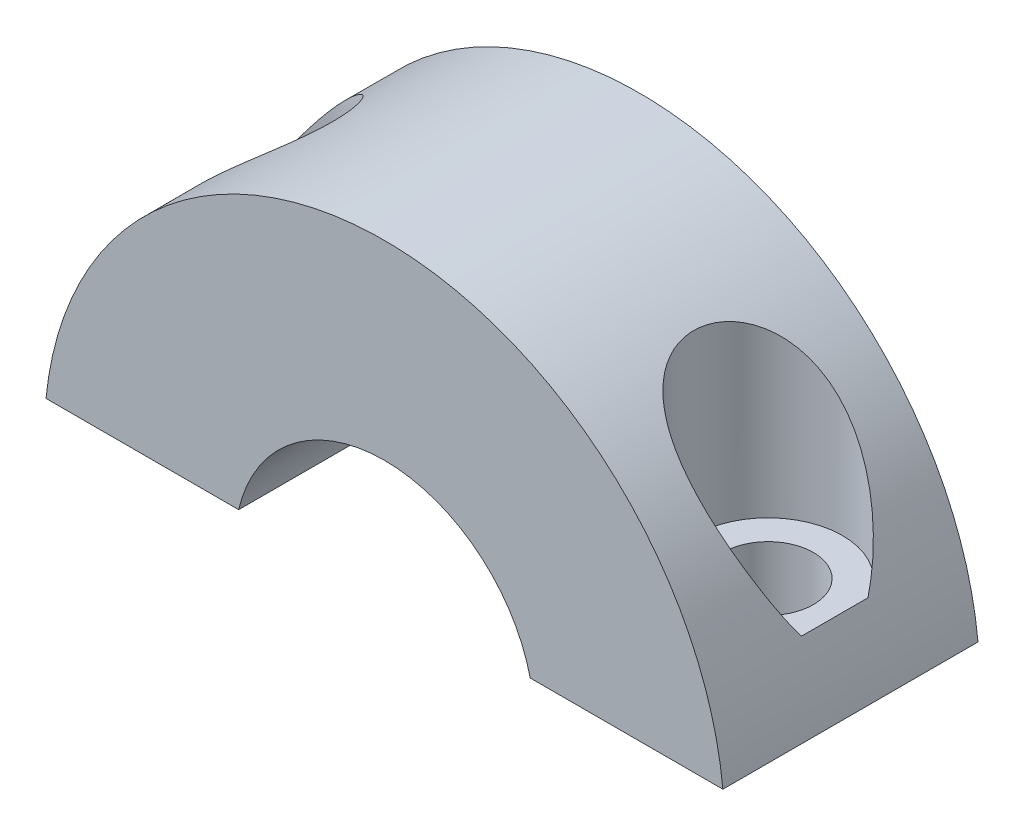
ISO-10303-21;
HEADER;
FILE_DESCRIPTION(('STEP AP214'),'2;1');
FILE_NAME('part.step','',(''),(''),'','','');
FILE_SCHEMA(('AUTOMOTIVE_DESIGN { 1 0 10303 214 1 1 1 1 }'));
ENDSEC;
DATA;
#1=APPLICATION_CONTEXT('core data for automotive mechanical design processes');
#2=APPLICATION_PROTOCOL_DEFINITION('international standard','automotive_design',2000,#1);
#3=PRODUCT_CONTEXT('',#1,'mechanical');
#4=PRODUCT('Part','Part','',(#3));
#5=PRODUCT_RELATED_PRODUCT_CATEGORY('part','',(#4));
#6=PRODUCT_DEFINITION_FORMATION('','',#4);
#7=PRODUCT_DEFINITION_CONTEXT('part definition',#1,'design');
#8=PRODUCT_DEFINITION('design','',#6,#7);
#9=PRODUCT_DEFINITION_SHAPE('','',#8);
#10=(LENGTH_UNIT() NAMED_UNIT(*) SI_UNIT(.MILLI.,.METRE.));
#11=(NAMED_UNIT(*) PLANE_ANGLE_UNIT() SI_UNIT($,.RADIAN.));
#12=(NAMED_UNIT(*) SI_UNIT($,.STERADIAN.) SOLID_ANGLE_UNIT());
#13=UNCERTAINTY_MEASURE_WITH_UNIT(LENGTH_MEASURE(1.E-05),#10,'distance_accuracy_value','');
#14=(GEOMETRIC_REPRESENTATION_CONTEXT(3) GLOBAL_UNCERTAINTY_ASSIGNED_CONTEXT((#13)) GLOBAL_UNIT_ASSIGNED_CONTEXT((#10,
#11,#12)) REPRESENTATION_CONTEXT('',''));
#15=CARTESIAN_POINT('',(0.,0.,0.));
#16=DIRECTION('',(0.,0.,1.));
#17=DIRECTION('',(1.,0.,0.));
#18=AXIS2_PLACEMENT_3D('',#15,#16,#17);
#19=CARTESIAN_POINT('',(-25.2726809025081,2.54,19.05));
#20=DIRECTION('',(0.,1.,0.));
#21=DIRECTION('',(0.,0.,1.));
#22=AXIS2_PLACEMENT_3D('',#19,#20,#21);
#23=PLANE('',#22);
#24=CARTESIAN_POINT('',(-19.05,2.54,9.4488));
#25=DIRECTION('',(0.,1.,0.));
#26=DIRECTION('',(0.,0.,1.));
#27=AXIS2_PLACEMENT_3D('',#24,#25,#26);
#28=CIRCLE('',#27,3.3782);
#29=CARTESIAN_POINT('',(-19.05,2.54,12.827));
#30=VERTEX_POINT('',#29);
#31=EDGE_CURVE('E180',#30,#30,#28,.T.);
#32=ORIENTED_EDGE('',*,*,#31,.T.);
#33=EDGE_LOOP('',(#32));
#34=FACE_BOUND('',#33,.T.);
#35=DIRECTION('',(1.,0.,0.));
#36=VECTOR('',#35,1.);
#37=CARTESIAN_POINT('',(-25.2726809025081,2.54,0.));
#38=LINE('',#37,#36);
#39=CARTESIAN_POINT('',(-25.2726809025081,2.54,0.));
#40=VERTEX_POINT('',#39);
#41=CARTESIAN_POINT('',(-10.8835369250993,2.54,0.));
#42=VERTEX_POINT('',#41);
#43=EDGE_CURVE('E183',#40,#42,#38,.T.);
#44=ORIENTED_EDGE('',*,*,#43,.T.);
#45=DIRECTION('',(0.,0.,-1.));
#46=VECTOR('',#45,1.);
#47=CARTESIAN_POINT('',(-10.8835369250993,2.54,19.05));
#48=LINE('',#47,#46);
#49=CARTESIAN_POINT('',(-10.8835369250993,2.54,19.05));
#50=VERTEX_POINT('',#49);
#51=EDGE_CURVE('E138',#50,#42,#48,.T.);
#52=ORIENTED_EDGE('',*,*,#51,.F.);
#53=DIRECTION('',(1.,0.,0.));
#54=VECTOR('',#53,1.);
#55=CARTESIAN_POINT('',(-25.2726809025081,2.54,19.05));
#56=LINE('',#55,#54);
#57=CARTESIAN_POINT('',(-25.2726809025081,2.54,19.05));
#58=VERTEX_POINT('',#57);
#59=EDGE_CURVE('E124',#58,#50,#56,.T.);
#60=ORIENTED_EDGE('',*,*,#59,.F.);
#61=DIRECTION('',(0.,0.,-1.));
#62=VECTOR('',#61,1.);
#63=CARTESIAN_POINT('',(-25.2726809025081,2.54,19.05));
#64=LINE('',#63,#62);
#65=EDGE_CURVE('E116',#58,#40,#64,.T.);
#66=ORIENTED_EDGE('',*,*,#65,.T.);
#67=EDGE_LOOP('',(#44,#52,#60,#66));
#68=FACE_BOUND('',#67,.T.);
#69=ADVANCED_FACE('F45',(#34,#68),#23,.F.);
#70=CARTESIAN_POINT('',(0.,0.,19.05));
#71=DIRECTION('',(0.,0.,-1.));
#72=DIRECTION('',(-1.,0.,0.));
#73=AXIS2_PLACEMENT_3D('',#70,#71,#72);
#74=CYLINDRICAL_SURFACE('',#73,11.176);
#75=CARTESIAN_POINT('',(0.,0.,0.));
#76=DIRECTION('',(0.,0.,1.));
#77=DIRECTION('',(1.,0.,0.));
#78=AXIS2_PLACEMENT_3D('',#75,#76,#77);
#79=CIRCLE('',#78,11.176);
#80=CARTESIAN_POINT('',(10.8835369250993,2.54,0.));
#81=VERTEX_POINT('',#80);
#82=EDGE_CURVE('E129',#81,#42,#79,.T.);
#83=ORIENTED_EDGE('',*,*,#82,.F.);
#84=DIRECTION('',(0.,0.,-1.));
#85=VECTOR('',#84,1.);
#86=CARTESIAN_POINT('',(10.8835369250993,2.54,19.05));
#87=LINE('',#86,#85);
#88=CARTESIAN_POINT('',(10.8835369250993,2.54,19.05));
#89=VERTEX_POINT('',#88);
#90=EDGE_CURVE('E136',#89,#81,#87,.T.);
#91=ORIENTED_EDGE('',*,*,#90,.F.);
#92=CARTESIAN_POINT('',(0.,0.,19.05));
#93=DIRECTION('',(0.,0.,1.));
#94=DIRECTION('',(1.,0.,0.));
#95=AXIS2_PLACEMENT_3D('',#92,#93,#94);
#96=CIRCLE('',#95,11.176);
#97=EDGE_CURVE('E127',#89,#50,#96,.T.);
#98=ORIENTED_EDGE('',*,*,#97,.T.);
#99=ORIENTED_EDGE('',*,*,#51,.T.);
#100=EDGE_LOOP('',(#83,#91,#98,#99));
#101=FACE_BOUND('',#100,.T.);
#102=ADVANCED_FACE('F171',(#101),#74,.F.);
#103=CARTESIAN_POINT('',(10.8835369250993,2.54,19.05));
#104=DIRECTION('',(0.,1.,0.));
#105=DIRECTION('',(0.,0.,1.));
#106=AXIS2_PLACEMENT_3D('',#103,#104,#105);
#107=PLANE('',#106);
#108=CARTESIAN_POINT('',(19.05,2.54,9.4488));
#109=DIRECTION('',(0.,1.,0.));
#110=DIRECTION('',(0.,0.,1.));
#111=AXIS2_PLACEMENT_3D('',#108,#109,#110);
#112=CIRCLE('',#111,3.3782);
#113=CARTESIAN_POINT('',(19.05,2.54,12.827));
#114=VERTEX_POINT('',#113);
#115=EDGE_CURVE('E198',#114,#114,#112,.T.);
#116=ORIENTED_EDGE('',*,*,#115,.T.);
#117=EDGE_LOOP('',(#116));
#118=FACE_BOUND('',#117,.T.);
#119=DIRECTION('',(1.,0.,0.));
#120=VECTOR('',#119,1.);
#121=CARTESIAN_POINT('',(10.8835369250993,2.54,0.));
#122=LINE('',#121,#120);
#123=CARTESIAN_POINT('',(25.2726809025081,2.54,0.));
#124=VERTEX_POINT('',#123);
#125=EDGE_CURVE('E125',#81,#124,#122,.T.);
#126=ORIENTED_EDGE('',*,*,#125,.T.);
#127=DIRECTION('',(0.,0.,-1.));
#128=VECTOR('',#127,1.);
#129=CARTESIAN_POINT('',(25.2726809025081,2.54,19.05));
#130=LINE('',#129,#128);
#131=CARTESIAN_POINT('',(25.2726809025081,2.54,19.05));
#132=VERTEX_POINT('',#131);
#133=EDGE_CURVE('E119',#132,#124,#130,.T.);
#134=ORIENTED_EDGE('',*,*,#133,.F.);
#135=DIRECTION('',(1.,0.,0.));
#136=VECTOR('',#135,1.);
#137=CARTESIAN_POINT('',(10.8835369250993,2.54,19.05));
#138=LINE('',#137,#136);
#139=EDGE_CURVE('E190',#89,#132,#138,.T.);
#140=ORIENTED_EDGE('',*,*,#139,.F.);
#141=ORIENTED_EDGE('',*,*,#90,.T.);
#142=EDGE_LOOP('',(#126,#134,#140,#141));
#143=FACE_BOUND('',#142,.T.);
#144=ADVANCED_FACE('F107',(#118,#143),#107,.F.);
#145=CARTESIAN_POINT('',(0.,0.,19.05));
#146=DIRECTION('',(0.,0.,-1.));
#147=DIRECTION('',(-1.,0.,0.));
#148=AXIS2_PLACEMENT_3D('',#145,#146,#147);
#149=CYLINDRICAL_SURFACE('',#148,25.4);
#150=DIRECTION('',(0.,0.,-1.));
#151=VECTOR('',#150,1.);
#152=CARTESIAN_POINT('',(24.0211360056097,8.255,19.05));
#153=LINE('',#152,#151);
#154=CARTESIAN_POINT('',(24.0211360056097,8.255,11.9306784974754));
#155=VERTEX_POINT('',#154);
#156=CARTESIAN_POINT('',(24.0211360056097,8.255,6.96692150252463));
#157=VERTEX_POINT('',#156);
#158=EDGE_CURVE('E13',#155,#157,#153,.T.);
#159=ORIENTED_EDGE('',*,*,#158,.F.);
#160=CARTESIAN_POINT('',(24.0211360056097,8.255,6.96692150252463));
#161=CARTESIAN_POINT('',(23.991830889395,8.34027801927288,6.90823569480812));
#162=CARTESIAN_POINT('',(23.961825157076,8.42611033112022,6.85072327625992));
#163=CARTESIAN_POINT('',(23.9004413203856,8.59867887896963,6.73784578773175));
#164=CARTESIAN_POINT('',(23.8690633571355,8.68541502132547,6.68248049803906));
#165=CARTESIAN_POINT('',(23.7729316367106,8.94662677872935,6.51933349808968));
#166=CARTESIAN_POINT('',(23.7061558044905,9.12217647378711,6.41445253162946));
#167=CARTESIAN_POINT('',(23.5673723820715,9.47496128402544,6.21146213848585));
#168=CARTESIAN_POINT('',(23.4953673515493,9.65219553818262,6.11334944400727));
#169=CARTESIAN_POINT('',(23.3461343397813,10.0077566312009,5.92321532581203));
#170=CARTESIAN_POINT('',(23.26890571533,10.1860836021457,5.83119465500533));
#171=CARTESIAN_POINT('',(23.1079420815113,10.5462100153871,5.65145756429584));
#172=CARTESIAN_POINT('',(23.0241213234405,10.728018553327,5.56383614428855));
#173=CARTESIAN_POINT('',(22.8511125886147,11.0917640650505,5.39440658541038));
#174=CARTESIAN_POINT('',(22.7619248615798,11.2737010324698,5.31259817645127));
#175=CARTESIAN_POINT('',(22.4862281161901,11.8192869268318,5.0758117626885));
#176=CARTESIAN_POINT('',(22.2916037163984,12.1826699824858,4.9294928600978));
#177=CARTESIAN_POINT('',(21.8659291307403,12.932130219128,4.65176356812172));
#178=CARTESIAN_POINT('',(21.6332685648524,13.3179692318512,4.52217093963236));
#179=CARTESIAN_POINT('',(21.1429697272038,14.083370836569,4.29473207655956));
#180=CARTESIAN_POINT('',(20.8853257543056,14.4629319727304,4.19689311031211));
#181=CARTESIAN_POINT('',(20.3474975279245,15.2101921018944,4.03894917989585));
#182=CARTESIAN_POINT('',(20.0674686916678,15.5779516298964,3.97860586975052));
#183=CARTESIAN_POINT('',(19.4853233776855,16.3002014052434,3.90186874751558));
#184=CARTESIAN_POINT('',(19.1832324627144,16.6547063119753,3.88542487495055));
#185=CARTESIAN_POINT('',(18.7174654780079,17.1717819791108,3.90035579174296));
#186=CARTESIAN_POINT('',(18.560599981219,17.3412011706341,3.91183795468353));
#187=CARTESIAN_POINT('',(18.2431112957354,17.6748927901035,3.94912796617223));
#188=CARTESIAN_POINT('',(18.0824886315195,17.8391659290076,3.97493382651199));
#189=CARTESIAN_POINT('',(17.7586016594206,18.1616152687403,4.04217982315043));
#190=CARTESIAN_POINT('',(17.5953391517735,18.3197953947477,4.0836097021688));
#191=CARTESIAN_POINT('',(17.2674075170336,18.6292085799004,4.18347539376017));
#192=CARTESIAN_POINT('',(17.1027386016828,18.7804426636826,4.24190868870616));
#193=CARTESIAN_POINT('',(16.8024089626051,19.049207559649,4.36531569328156));
#194=CARTESIAN_POINT('',(16.6666948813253,19.1680182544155,4.42737413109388));
#195=CARTESIAN_POINT('',(16.3966960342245,19.3994833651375,4.56466050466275));
#196=CARTESIAN_POINT('',(16.2624109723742,19.5121390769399,4.63988565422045));
#197=CARTESIAN_POINT('',(15.9967539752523,19.730519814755,4.80402183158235));
#198=CARTESIAN_POINT('',(15.8653801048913,19.8362495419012,4.89292343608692));
#199=CARTESIAN_POINT('',(15.607096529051,20.0400995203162,5.08483406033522));
#200=CARTESIAN_POINT('',(15.4801859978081,20.1382211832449,5.18784045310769));
#201=CARTESIAN_POINT('',(15.2551395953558,20.309035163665,5.38809333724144));
#202=CARTESIAN_POINT('',(15.1559613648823,20.3831108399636,5.48299286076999));
#203=CARTESIAN_POINT('',(14.962928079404,20.5252318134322,5.68223812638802));
#204=CARTESIAN_POINT('',(14.8690720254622,20.5932782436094,5.78658208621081));
#205=CARTESIAN_POINT('',(14.6878029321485,20.7229551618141,6.0044947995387));
#206=CARTESIAN_POINT('',(14.6003907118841,20.7845848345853,6.11806472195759));
#207=CARTESIAN_POINT('',(14.4332303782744,20.9010103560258,6.35392793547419));
#208=CARTESIAN_POINT('',(14.3534785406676,20.9558095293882,6.47621693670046));
#209=CARTESIAN_POINT('',(14.2022491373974,21.0585977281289,6.72976440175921));
#210=CARTESIAN_POINT('',(14.1308290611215,21.1065398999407,6.86107626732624));
#211=CARTESIAN_POINT('',(13.998017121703,21.1948550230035,7.13104232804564));
#212=CARTESIAN_POINT('',(13.936620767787,21.2352313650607,7.26969319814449));
#213=CARTESIAN_POINT('',(13.8248316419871,21.3081789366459,7.55334057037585));
#214=CARTESIAN_POINT('',(13.7744383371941,21.3407505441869,7.69833676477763));
#215=CARTESIAN_POINT('',(13.6855221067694,21.397880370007,7.99345374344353));
#216=CARTESIAN_POINT('',(13.6469978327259,21.4224394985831,8.14357394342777));
#217=CARTESIAN_POINT('',(13.585936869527,21.4612087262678,8.43135069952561));
#218=CARTESIAN_POINT('',(13.5621333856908,21.4762431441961,8.56862924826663));
#219=CARTESIAN_POINT('',(13.5248790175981,21.4997240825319,8.84513772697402));
#220=CARTESIAN_POINT('',(13.5114273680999,21.508171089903,8.98436751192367));
#221=CARTESIAN_POINT('',(13.4950751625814,21.5184348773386,9.26364019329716));
#222=CARTESIAN_POINT('',(13.4921710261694,21.5202539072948,9.40368279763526));
#223=CARTESIAN_POINT('',(13.4969465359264,21.5172591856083,9.68351599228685));
#224=CARTESIAN_POINT('',(13.504625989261,21.5124455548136,9.82330658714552));
#225=CARTESIAN_POINT('',(13.5297933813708,21.4966252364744,10.0944072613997));
#226=CARTESIAN_POINT('',(13.5467596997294,21.4859478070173,10.2257854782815));
#227=CARTESIAN_POINT('',(13.5899023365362,21.4586860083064,10.4864431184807));
#228=CARTESIAN_POINT('',(13.6160816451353,21.4420997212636,10.6157218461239));
#229=CARTESIAN_POINT('',(13.677297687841,21.4031035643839,10.8712035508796));
#230=CARTESIAN_POINT('',(13.7123305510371,21.3806962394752,10.9974078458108));
#231=CARTESIAN_POINT('',(13.7908307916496,21.330146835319,11.2460353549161));
#232=CARTESIAN_POINT('',(13.8343013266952,21.3020026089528,11.3684571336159));
#233=CARTESIAN_POINT('',(13.9298721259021,21.2396319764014,11.6106070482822));
#234=CARTESIAN_POINT('',(13.9820960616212,21.2053178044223,11.7302637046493));
#235=CARTESIAN_POINT('',(14.0940640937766,21.1310640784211,11.9642406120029));
#236=CARTESIAN_POINT('',(14.1538108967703,21.0911224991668,12.0785589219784));
#237=CARTESIAN_POINT('',(14.280095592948,21.005824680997,12.3012206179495));
#238=CARTESIAN_POINT('',(14.3466317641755,20.9604698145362,12.4095655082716));
#239=CARTESIAN_POINT('',(14.4857925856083,20.8645383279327,12.6198937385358));
#240=CARTESIAN_POINT('',(14.5584194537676,20.8139598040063,12.7218747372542));
#241=CARTESIAN_POINT('',(14.7148077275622,20.7037258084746,12.9267124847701));
#242=CARTESIAN_POINT('',(14.7989958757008,20.6436710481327,13.0290291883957));
#243=CARTESIAN_POINT('',(14.9726087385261,20.5181019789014,13.2255733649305));
#244=CARTESIAN_POINT('',(15.0620355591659,20.4525854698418,13.3197975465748));
#245=CARTESIAN_POINT('',(15.3368309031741,20.2482949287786,13.5900795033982));
#246=CARTESIAN_POINT('',(15.5287678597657,20.1017425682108,13.753815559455));
#247=CARTESIAN_POINT('',(15.8651042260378,19.8365854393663,14.0049699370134));
#248=CARTESIAN_POINT('',(16.0069544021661,19.7223735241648,14.1006927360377));
#249=CARTESIAN_POINT('',(16.2939180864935,19.4859627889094,14.2762414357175));
#250=CARTESIAN_POINT('',(16.4390326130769,19.3637614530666,14.3560622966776));
#251=CARTESIAN_POINT('',(16.7308655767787,19.1121771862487,14.5005412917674));
#252=CARTESIAN_POINT('',(16.8775857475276,18.9827857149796,14.5651808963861));
#253=CARTESIAN_POINT('',(17.1710424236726,18.7177569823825,14.6800778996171));
#254=CARTESIAN_POINT('',(17.3177789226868,18.5821180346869,14.7303313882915));
#255=CARTESIAN_POINT('',(17.6645735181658,18.2537422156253,14.8336253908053));
#256=CARTESIAN_POINT('',(17.864111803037,18.0585739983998,14.8807177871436));
#257=CARTESIAN_POINT('',(18.258601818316,17.6596224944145,14.9520545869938));
#258=CARTESIAN_POINT('',(18.4535518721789,17.4558361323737,14.9762907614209));
#259=CARTESIAN_POINT('',(18.8374586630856,17.0408381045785,15.0043229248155));
#260=CARTESIAN_POINT('',(19.0264062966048,16.8296160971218,15.0080892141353));
#261=CARTESIAN_POINT('',(19.3968640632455,16.4012775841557,14.9973077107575));
#262=CARTESIAN_POINT('',(19.5783740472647,16.184160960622,14.982759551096));
#263=CARTESIAN_POINT('',(20.0147088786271,15.6441989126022,14.9268851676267));
#264=CARTESIAN_POINT('',(20.2649373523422,15.3185735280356,14.8763317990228));
#265=CARTESIAN_POINT('',(20.746691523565,14.6595234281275,14.7455431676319));
#266=CARTESIAN_POINT('',(20.978208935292,14.3260953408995,14.6652948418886));
#267=CARTESIAN_POINT('',(21.4223173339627,13.6531000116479,14.478920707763));
#268=CARTESIAN_POINT('',(21.634874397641,13.3135230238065,14.3727497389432));
#269=CARTESIAN_POINT('',(22.0404637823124,12.630740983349,14.1375117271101));
#270=CARTESIAN_POINT('',(22.2334972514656,12.2875361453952,14.0084460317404));
#271=CARTESIAN_POINT('',(22.5825891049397,11.6323256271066,13.7425334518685));
#272=CARTESIAN_POINT('',(22.7404181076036,11.3204755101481,13.6076114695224));
#273=CARTESIAN_POINT('',(23.0402549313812,10.6970169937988,13.3208613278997));
#274=CARTESIAN_POINT('',(23.1822671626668,10.3854085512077,13.1690379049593));
#275=CARTESIAN_POINT('',(23.3829678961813,9.9209394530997,12.9284664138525));
#276=CARTESIAN_POINT('',(23.4476141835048,9.76712992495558,12.8464397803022));
#277=CARTESIAN_POINT('',(23.5729912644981,9.46052368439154,12.6776566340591));
#278=CARTESIAN_POINT('',(23.6337224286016,9.30772687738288,12.5909005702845));
#279=CARTESIAN_POINT('',(23.75127005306,9.00353980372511,12.4121536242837));
#280=CARTESIAN_POINT('',(23.8080840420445,8.85215047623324,12.3201595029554));
#281=CARTESIAN_POINT('',(23.9176715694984,8.55164943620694,12.1301411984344));
#282=CARTESIAN_POINT('',(23.9704438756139,8.40253842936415,12.0321151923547));
#283=CARTESIAN_POINT('',(24.0211360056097,8.255,11.9306784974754));
#284=B_SPLINE_CURVE_WITH_KNOTS('',3,(#160,#161,#162,#163,#164,#165,#166,#167,#168,#169,#170,
#171,#172,#173,#174,#175,#176,#177,#178,#179,#180,#181,#182,#183,#184,#185,#186,#187,#188,#189,
#190,#191,#192,#193,#194,#195,#196,#197,#198,#199,#200,#201,#202,#203,#204,#205,#206,#207,#208,
#209,#210,#211,#212,#213,#214,#215,#216,#217,#218,#219,#220,#221,#222,#223,#224,#225,#226,#227,
#228,#229,#230,#231,#232,#233,#234,#235,#236,#237,#238,#239,#240,#241,#242,#243,#244,#245,#246,
#247,#248,#249,#250,#251,#252,#253,#254,#255,#256,#257,#258,#259,#260,#261,#262,#263,#264,#265,
#266,#267,#268,#269,#270,#271,#272,#273,#274,#275,#276,#277,#278,#279,#280,#281,#282,#283),
.UNSPECIFIED.,.F.,.F.,(4,2,2,2,2,2,2,2,2,2,2,2,2,2,2,2,2,2,2,2,2,2,2,2,2,2,2,2,2,2,2,2,2,2,2,2,
2,2,2,2,2,2,2,2,2,2,2,2,2,2,2,2,2,2,2,2,2,2,2,2,2,4),(0.,0.322737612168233,0.645442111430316,
1.29058458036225,1.93541335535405,2.58032167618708,3.23577655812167,3.89120096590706,
5.20219677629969,6.60706715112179,8.01225887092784,9.40842439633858,10.8029971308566,
11.4960869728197,12.1890806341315,12.8816201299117,13.574057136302,14.1458012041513,
14.7174244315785,15.2886555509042,15.8597804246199,16.327261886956,16.7946553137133,
17.2621080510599,17.7293323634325,18.1996105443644,18.6696774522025,19.1397215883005,
19.6097123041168,20.0295844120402,20.4494254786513,20.8691240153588,21.2888149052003,
21.6870455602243,22.085405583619,22.4835917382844,22.8819271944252,23.286456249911,
23.6911312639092,24.0957038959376,24.5004244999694,24.9363857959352,25.3725235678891,
26.2445172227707,26.8610148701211,27.4777075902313,28.095149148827,28.7127583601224,
29.5606638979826,30.4088745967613,31.2583156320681,32.1077736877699,33.347198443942,
34.5871690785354,35.8293155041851,37.0713888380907,38.1946647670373,39.3176267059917,
39.8752926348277,40.432905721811,40.9908674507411,41.5489986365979),.UNSPECIFIED.);
#285=EDGE_CURVE('E52',#157,#155,#284,.T.);
#286=ORIENTED_EDGE('',*,*,#285,.F.);
#287=EDGE_LOOP('',(#159,#286));
#288=FACE_BOUND('',#287,.T.);
#289=DIRECTION('',(0.,0.,-1.));
#290=VECTOR('',#289,1.);
#291=CARTESIAN_POINT('',(-24.0211360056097,8.255,19.05));
#292=LINE('',#291,#290);
#293=CARTESIAN_POINT('',(-24.0211360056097,8.255,6.96692150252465));
#294=VERTEX_POINT('',#293);
#295=CARTESIAN_POINT('',(-24.0211360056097,8.255,11.9306784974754));
#296=VERTEX_POINT('',#295);
#297=EDGE_CURVE('E97',#294,#296,#292,.F.);
#298=ORIENTED_EDGE('',*,*,#297,.F.);
#299=CARTESIAN_POINT('',(-24.0211360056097,8.255,11.9306784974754));
#300=CARTESIAN_POINT('',(-23.991830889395,8.34027801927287,11.9893643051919));
#301=CARTESIAN_POINT('',(-23.961825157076,8.42611033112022,12.0468767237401));
#302=CARTESIAN_POINT('',(-23.9004413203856,8.59867887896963,12.1597542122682));
#303=CARTESIAN_POINT('',(-23.8690633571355,8.68541502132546,12.2151195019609));
#304=CARTESIAN_POINT('',(-23.7729316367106,8.94662677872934,12.3782665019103));
#305=CARTESIAN_POINT('',(-23.7061558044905,9.12217647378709,12.4831474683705));
#306=CARTESIAN_POINT('',(-23.5673723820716,9.47496128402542,12.6861378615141));
#307=CARTESIAN_POINT('',(-23.4953673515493,9.6521955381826,12.7842505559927));
#308=CARTESIAN_POINT('',(-23.3461343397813,10.0077566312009,12.974384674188));
#309=CARTESIAN_POINT('',(-23.26890571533,10.1860836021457,13.0664053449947));
#310=CARTESIAN_POINT('',(-23.1079420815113,10.5462100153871,13.2461424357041));
#311=CARTESIAN_POINT('',(-23.0241213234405,10.728018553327,13.3337638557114));
#312=CARTESIAN_POINT('',(-22.8511125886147,11.0917640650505,13.5031934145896));
#313=CARTESIAN_POINT('',(-22.7619248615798,11.2737010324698,13.5850018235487));
#314=CARTESIAN_POINT('',(-22.4862281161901,11.8192869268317,13.8217882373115));
#315=CARTESIAN_POINT('',(-22.2916037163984,12.1826699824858,13.9681071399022));
#316=CARTESIAN_POINT('',(-21.8659291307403,12.9321302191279,14.2458364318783));
#317=CARTESIAN_POINT('',(-21.6332685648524,13.3179692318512,14.3754290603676));
#318=CARTESIAN_POINT('',(-21.1429697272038,14.0833708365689,14.6028679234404));
#319=CARTESIAN_POINT('',(-20.8853257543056,14.4629319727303,14.7007068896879));
#320=CARTESIAN_POINT('',(-20.3474975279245,15.2101921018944,14.8586508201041));
#321=CARTESIAN_POINT('',(-20.0674686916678,15.5779516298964,14.9189941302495));
#322=CARTESIAN_POINT('',(-19.4853233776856,16.3002014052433,14.9957312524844));
#323=CARTESIAN_POINT('',(-19.1832324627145,16.6547063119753,15.0121751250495));
#324=CARTESIAN_POINT('',(-18.717465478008,17.1717819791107,14.9972442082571));
#325=CARTESIAN_POINT('',(-18.5605999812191,17.3412011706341,14.9857620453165));
#326=CARTESIAN_POINT('',(-18.2431112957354,17.6748927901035,14.9484720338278));
#327=CARTESIAN_POINT('',(-18.0824886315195,17.8391659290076,14.922666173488));
#328=CARTESIAN_POINT('',(-17.7586016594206,18.1616152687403,14.8554201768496));
#329=CARTESIAN_POINT('',(-17.5953391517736,18.3197953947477,14.8139902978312));
#330=CARTESIAN_POINT('',(-17.2674075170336,18.6292085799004,14.7141246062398));
#331=CARTESIAN_POINT('',(-17.1027386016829,18.7804426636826,14.6556913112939));
#332=CARTESIAN_POINT('',(-16.8024089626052,19.0492075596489,14.5322843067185));
#333=CARTESIAN_POINT('',(-16.6666948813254,19.1680182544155,14.4702258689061));
#334=CARTESIAN_POINT('',(-16.3966960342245,19.3994833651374,14.3329394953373));
#335=CARTESIAN_POINT('',(-16.2624109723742,19.5121390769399,14.2577143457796));
#336=CARTESIAN_POINT('',(-15.9967539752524,19.7305198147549,14.0935781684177));
#337=CARTESIAN_POINT('',(-15.8653801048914,19.8362495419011,14.0046765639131));
#338=CARTESIAN_POINT('',(-15.6070965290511,20.0400995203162,13.8127659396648));
#339=CARTESIAN_POINT('',(-15.4801859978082,20.1382211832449,13.7097595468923));
#340=CARTESIAN_POINT('',(-15.2551395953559,20.3090351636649,13.5095066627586));
#341=CARTESIAN_POINT('',(-15.1559613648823,20.3831108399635,13.41460713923));
#342=CARTESIAN_POINT('',(-14.962928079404,20.5252318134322,13.215361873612));
#343=CARTESIAN_POINT('',(-14.8690720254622,20.5932782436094,13.1110179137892));
#344=CARTESIAN_POINT('',(-14.6878029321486,20.7229551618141,12.8931052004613));
#345=CARTESIAN_POINT('',(-14.6003907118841,20.7845848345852,12.7795352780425));
#346=CARTESIAN_POINT('',(-14.4332303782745,20.9010103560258,12.5436720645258));
#347=CARTESIAN_POINT('',(-14.3534785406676,20.9558095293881,12.4213830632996));
#348=CARTESIAN_POINT('',(-14.2022491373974,21.0585977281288,12.1678355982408));
#349=CARTESIAN_POINT('',(-14.1308290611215,21.1065398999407,12.0365237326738));
#350=CARTESIAN_POINT('',(-13.998017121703,21.1948550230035,11.7665576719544));
#351=CARTESIAN_POINT('',(-13.936620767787,21.2352313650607,11.6279068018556));
#352=CARTESIAN_POINT('',(-13.8248316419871,21.3081789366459,11.3442594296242));
#353=CARTESIAN_POINT('',(-13.7744383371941,21.3407505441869,11.1992632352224));
#354=CARTESIAN_POINT('',(-13.6855221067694,21.397880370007,10.9041462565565));
#355=CARTESIAN_POINT('',(-13.6469978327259,21.4224394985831,10.7540260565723));
#356=CARTESIAN_POINT('',(-13.585936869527,21.4612087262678,10.4662493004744));
#357=CARTESIAN_POINT('',(-13.5621333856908,21.4762431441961,10.3289707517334));
#358=CARTESIAN_POINT('',(-13.5248790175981,21.4997240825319,10.052462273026));
#359=CARTESIAN_POINT('',(-13.5114273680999,21.508171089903,9.91323248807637));
#360=CARTESIAN_POINT('',(-13.4950751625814,21.5184348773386,9.63395980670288));
#361=CARTESIAN_POINT('',(-13.4921710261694,21.5202539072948,9.49391720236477));
#362=CARTESIAN_POINT('',(-13.4969465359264,21.5172591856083,9.21408400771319));
#363=CARTESIAN_POINT('',(-13.5046259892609,21.5124455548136,9.07429341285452));
#364=CARTESIAN_POINT('',(-13.5297933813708,21.4966252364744,8.80319273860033));
#365=CARTESIAN_POINT('',(-13.5467596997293,21.4859478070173,8.67181452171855));
#366=CARTESIAN_POINT('',(-13.5899023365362,21.4586860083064,8.41115688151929));
#367=CARTESIAN_POINT('',(-13.6160816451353,21.4420997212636,8.28187815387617));
#368=CARTESIAN_POINT('',(-13.677297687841,21.4031035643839,8.02639644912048));
#369=CARTESIAN_POINT('',(-13.7123305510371,21.3806962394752,7.90019215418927));
#370=CARTESIAN_POINT('',(-13.7908307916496,21.330146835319,7.65156464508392));
#371=CARTESIAN_POINT('',(-13.8343013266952,21.3020026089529,7.5291428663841));
#372=CARTESIAN_POINT('',(-13.9298721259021,21.2396319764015,7.28699295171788));
#373=CARTESIAN_POINT('',(-13.9820960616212,21.2053178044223,7.16733629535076));
#374=CARTESIAN_POINT('',(-14.0940640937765,21.1310640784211,6.93335938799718));
#375=CARTESIAN_POINT('',(-14.1538108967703,21.0911224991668,6.81904107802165));
#376=CARTESIAN_POINT('',(-14.280095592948,21.005824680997,6.59637938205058));
#377=CARTESIAN_POINT('',(-14.3466317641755,20.9604698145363,6.48803449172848));
#378=CARTESIAN_POINT('',(-14.4857925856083,20.8645383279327,6.27770626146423));
#379=CARTESIAN_POINT('',(-14.5584194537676,20.8139598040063,6.1757252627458));
#380=CARTESIAN_POINT('',(-14.7148077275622,20.7037258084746,5.97088751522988));
#381=CARTESIAN_POINT('',(-14.7989958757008,20.6436710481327,5.86857081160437));
#382=CARTESIAN_POINT('',(-14.972608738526,20.5181019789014,5.67202663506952));
#383=CARTESIAN_POINT('',(-15.0620355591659,20.4525854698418,5.57780245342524));
#384=CARTESIAN_POINT('',(-15.3368309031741,20.2482949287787,5.30752049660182));
#385=CARTESIAN_POINT('',(-15.5287678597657,20.1017425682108,5.14378444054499));
#386=CARTESIAN_POINT('',(-15.8651042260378,19.8365854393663,4.89263006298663));
#387=CARTESIAN_POINT('',(-16.0069544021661,19.7223735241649,4.79690726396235));
#388=CARTESIAN_POINT('',(-16.2939180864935,19.4859627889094,4.62135856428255));
#389=CARTESIAN_POINT('',(-16.4390326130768,19.3637614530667,4.54153770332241));
#390=CARTESIAN_POINT('',(-16.7308655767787,19.1121771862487,4.39705870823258));
#391=CARTESIAN_POINT('',(-16.8775857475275,18.9827857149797,4.33241910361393));
#392=CARTESIAN_POINT('',(-17.1710424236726,18.7177569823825,4.21752210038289));
#393=CARTESIAN_POINT('',(-17.3177789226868,18.582118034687,4.16726861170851));
#394=CARTESIAN_POINT('',(-17.6645735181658,18.2537422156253,4.06397460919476));
#395=CARTESIAN_POINT('',(-17.8641118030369,18.0585739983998,4.01688221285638));
#396=CARTESIAN_POINT('',(-18.258601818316,17.6596224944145,3.9455454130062));
#397=CARTESIAN_POINT('',(-18.4535518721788,17.4558361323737,3.92130923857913));
#398=CARTESIAN_POINT('',(-18.8374586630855,17.0408381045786,3.89327707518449));
#399=CARTESIAN_POINT('',(-19.0264062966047,16.8296160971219,3.8895107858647));
#400=CARTESIAN_POINT('',(-19.3968640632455,16.4012775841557,3.90029228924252));
#401=CARTESIAN_POINT('',(-19.5783740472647,16.1841609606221,3.91484044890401));
#402=CARTESIAN_POINT('',(-20.0147088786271,15.6441989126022,3.97071483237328));
#403=CARTESIAN_POINT('',(-20.2649373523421,15.3185735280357,4.02126820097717));
#404=CARTESIAN_POINT('',(-20.746691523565,14.6595234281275,4.15205683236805));
#405=CARTESIAN_POINT('',(-20.9782089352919,14.3260953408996,4.23230515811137));
#406=CARTESIAN_POINT('',(-21.4223173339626,13.6531000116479,4.41867929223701));
#407=CARTESIAN_POINT('',(-21.634874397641,13.3135230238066,4.52485026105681));
#408=CARTESIAN_POINT('',(-22.0404637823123,12.6307409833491,4.76008827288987));
#409=CARTESIAN_POINT('',(-22.2334972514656,12.2875361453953,4.88915396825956));
#410=CARTESIAN_POINT('',(-22.5825891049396,11.6323256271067,5.15506654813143));
#411=CARTESIAN_POINT('',(-22.7404181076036,11.3204755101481,5.28998853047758));
#412=CARTESIAN_POINT('',(-23.0402549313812,10.6970169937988,5.57673867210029));
#413=CARTESIAN_POINT('',(-23.1822671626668,10.3854085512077,5.72856209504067));
#414=CARTESIAN_POINT('',(-23.3829678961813,9.92093945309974,5.96913358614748));
#415=CARTESIAN_POINT('',(-23.4476141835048,9.76712992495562,6.05116021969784));
#416=CARTESIAN_POINT('',(-23.5729912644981,9.46052368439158,6.21994336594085));
#417=CARTESIAN_POINT('',(-23.6337224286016,9.30772687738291,6.30669942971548));
#418=CARTESIAN_POINT('',(-23.75127005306,9.00353980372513,6.48544637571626));
#419=CARTESIAN_POINT('',(-23.8080840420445,8.85215047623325,6.57744049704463));
#420=CARTESIAN_POINT('',(-23.9176715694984,8.55164943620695,6.76745880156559));
#421=CARTESIAN_POINT('',(-23.9704438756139,8.40253842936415,6.86548480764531));
#422=CARTESIAN_POINT('',(-24.0211360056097,8.255,6.96692150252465));
#423=B_SPLINE_CURVE_WITH_KNOTS('',3,(#299,#300,#301,#302,#303,#304,#305,#306,#307,#308,#309,
#310,#311,#312,#313,#314,#315,#316,#317,#318,#319,#320,#321,#322,#323,#324,#325,#326,#327,#328,
#329,#330,#331,#332,#333,#334,#335,#336,#337,#338,#339,#340,#341,#342,#343,#344,#345,#346,#347,
#348,#349,#350,#351,#352,#353,#354,#355,#356,#357,#358,#359,#360,#361,#362,#363,#364,#365,#366,
#367,#368,#369,#370,#371,#372,#373,#374,#375,#376,#377,#378,#379,#380,#381,#382,#383,#384,#385,
#386,#387,#388,#389,#390,#391,#392,#393,#394,#395,#396,#397,#398,#399,#400,#401,#402,#403,#404,
#405,#406,#407,#408,#409,#410,#411,#412,#413,#414,#415,#416,#417,#418,#419,#420,#421,#422),
.UNSPECIFIED.,.F.,.F.,(4,2,2,2,2,2,2,2,2,2,2,2,2,2,2,2,2,2,2,2,2,2,2,2,2,2,2,2,2,2,2,2,2,2,2,2,
2,2,2,2,2,2,2,2,2,2,2,2,2,2,2,2,2,2,2,2,2,2,2,2,2,4),(0.,0.322737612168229,0.645442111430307,
1.29058458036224,1.93541335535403,2.58032167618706,3.23577655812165,3.89120096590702,
5.20219677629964,6.60706715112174,8.01225887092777,9.40842439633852,10.8029971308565,
11.4960869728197,12.1890806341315,12.8816201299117,13.5740571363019,14.1458012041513,
14.7174244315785,15.2886555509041,15.8597804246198,16.327261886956,16.7946553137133,
17.2621080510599,17.7293323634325,18.1996105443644,18.6696774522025,19.1397215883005,
19.6097123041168,20.0295844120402,20.4494254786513,20.8691240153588,21.2888149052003,
21.6870455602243,22.0854055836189,22.4835917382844,22.8819271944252,23.286456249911,
23.6911312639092,24.0957038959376,24.5004244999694,24.9363857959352,25.372523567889,
26.2445172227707,26.861014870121,27.4777075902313,28.095149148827,28.7127583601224,
29.5606638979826,30.4088745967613,31.2583156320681,32.1077736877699,33.347198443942,
34.5871690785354,35.829315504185,37.0713888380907,38.1946647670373,39.3176267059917,
39.8752926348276,40.432905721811,40.9908674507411,41.548998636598),.UNSPECIFIED.);
#424=EDGE_CURVE('E140',#296,#294,#423,.T.);
#425=ORIENTED_EDGE('',*,*,#424,.F.);
#426=EDGE_LOOP('',(#298,#425));
#427=FACE_BOUND('',#426,.T.);
#428=CARTESIAN_POINT('',(0.,0.,0.));
#429=DIRECTION('',(0.,0.,-1.));
#430=DIRECTION('',(-1.,0.,0.));
#431=AXIS2_PLACEMENT_3D('',#428,#429,#430);
#432=CIRCLE('',#431,25.4);
#433=EDGE_CURVE('E114',#40,#124,#432,.T.);
#434=ORIENTED_EDGE('',*,*,#433,.F.);
#435=ORIENTED_EDGE('',*,*,#65,.F.);
#436=CARTESIAN_POINT('',(0.,0.,19.05));
#437=DIRECTION('',(0.,0.,-1.));
#438=DIRECTION('',(-1.,0.,0.));
#439=AXIS2_PLACEMENT_3D('',#436,#437,#438);
#440=CIRCLE('',#439,25.4);
#441=EDGE_CURVE('E134',#58,#132,#440,.T.);
#442=ORIENTED_EDGE('',*,*,#441,.T.);
#443=ORIENTED_EDGE('',*,*,#133,.T.);
#444=EDGE_LOOP('',(#434,#435,#442,#443));
#445=FACE_BOUND('',#444,.T.);
#446=ADVANCED_FACE('F103',(#288,#427,#445),#149,.T.);
#447=CARTESIAN_POINT('',(0.,0.,19.05));
#448=DIRECTION('',(0.,0.,1.));
#449=DIRECTION('',(1.,0.,0.));
#450=AXIS2_PLACEMENT_3D('',#447,#448,#449);
#451=PLANE('',#450);
#452=ORIENTED_EDGE('',*,*,#59,.T.);
#453=ORIENTED_EDGE('',*,*,#97,.F.);
#454=ORIENTED_EDGE('',*,*,#139,.T.);
#455=ORIENTED_EDGE('',*,*,#441,.F.);
#456=EDGE_LOOP('',(#452,#453,#454,#455));
#457=FACE_BOUND('',#456,.T.);
#458=ADVANCED_FACE('F106',(#457),#451,.T.);
#459=CARTESIAN_POINT('',(0.,0.,0.));
#460=DIRECTION('',(0.,0.,1.));
#461=DIRECTION('',(1.,0.,0.));
#462=AXIS2_PLACEMENT_3D('',#459,#460,#461);
#463=PLANE('',#462);
#464=ORIENTED_EDGE('',*,*,#43,.F.);
#465=ORIENTED_EDGE('',*,*,#433,.T.);
#466=ORIENTED_EDGE('',*,*,#125,.F.);
#467=ORIENTED_EDGE('',*,*,#82,.T.);
#468=EDGE_LOOP('',(#464,#465,#466,#467));
#469=FACE_BOUND('',#468,.T.);
#470=ADVANCED_FACE('F163',(#469),#463,.F.);
#471=CARTESIAN_POINT('',(-19.05,28.575,9.4488));
#472=DIRECTION('',(0.,1.,0.));
#473=DIRECTION('',(0.,0.,1.));
#474=AXIS2_PLACEMENT_3D('',#471,#472,#473);
#475=CYLINDRICAL_SURFACE('',#474,3.3782);
#476=ORIENTED_EDGE('',*,*,#31,.F.);
#477=EDGE_LOOP('',(#476));
#478=FACE_BOUND('',#477,.T.);
#479=CARTESIAN_POINT('',(-19.05,8.255,9.4488));
#480=DIRECTION('',(0.,1.,0.));
#481=DIRECTION('',(0.,0.,1.));
#482=AXIS2_PLACEMENT_3D('',#479,#480,#481);
#483=CIRCLE('',#482,3.3782);
#484=CARTESIAN_POINT('',(-19.05,8.255,12.827));
#485=VERTEX_POINT('',#484);
#486=EDGE_CURVE('E194',#485,#485,#483,.T.);
#487=ORIENTED_EDGE('',*,*,#486,.T.);
#488=EDGE_LOOP('',(#487));
#489=FACE_BOUND('',#488,.T.);
#490=ADVANCED_FACE('F159',(#478,#489),#475,.F.);
#491=CARTESIAN_POINT('',(-15.6718,8.255,9.4488));
#492=DIRECTION('',(0.,-1.,0.));
#493=DIRECTION('',(0.,0.,-1.));
#494=AXIS2_PLACEMENT_3D('',#491,#492,#493);
#495=PLANE('',#494);
#496=ORIENTED_EDGE('',*,*,#297,.T.);
#497=CARTESIAN_POINT('',(-19.05,8.255,9.4488));
#498=DIRECTION('',(0.,1.,0.));
#499=DIRECTION('',(0.,0.,1.));
#500=AXIS2_PLACEMENT_3D('',#497,#498,#499);
#501=CIRCLE('',#500,5.55625);
#502=EDGE_CURVE('E64',#296,#294,#501,.T.);
#503=ORIENTED_EDGE('',*,*,#502,.T.);
#504=EDGE_LOOP('',(#496,#503));
#505=FACE_BOUND('',#504,.T.);
#506=ORIENTED_EDGE('',*,*,#486,.F.);
#507=EDGE_LOOP('',(#506));
#508=FACE_BOUND('',#507,.T.);
#509=ADVANCED_FACE('F155',(#505,#508),#495,.F.);
#510=CARTESIAN_POINT('',(-19.05,28.575,9.4488));
#511=DIRECTION('',(0.,1.,0.));
#512=DIRECTION('',(0.,0.,1.));
#513=AXIS2_PLACEMENT_3D('',#510,#511,#512);
#514=CYLINDRICAL_SURFACE('',#513,5.55625);
#515=ORIENTED_EDGE('',*,*,#424,.T.);
#516=ORIENTED_EDGE('',*,*,#502,.F.);
#517=EDGE_LOOP('',(#515,#516));
#518=FACE_BOUND('',#517,.T.);
#519=ADVANCED_FACE('F149',(#518),#514,.F.);
#520=CARTESIAN_POINT('',(19.05,28.575,9.4488));
#521=DIRECTION('',(0.,1.,0.));
#522=DIRECTION('',(0.,0.,1.));
#523=AXIS2_PLACEMENT_3D('',#520,#521,#522);
#524=CYLINDRICAL_SURFACE('',#523,3.3782);
#525=ORIENTED_EDGE('',*,*,#115,.F.);
#526=EDGE_LOOP('',(#525));
#527=FACE_BOUND('',#526,.T.);
#528=CARTESIAN_POINT('',(19.05,8.255,9.4488));
#529=DIRECTION('',(0.,1.,0.));
#530=DIRECTION('',(0.,0.,1.));
#531=AXIS2_PLACEMENT_3D('',#528,#529,#530);
#532=CIRCLE('',#531,3.3782);
#533=CARTESIAN_POINT('',(19.05,8.255,12.827));
#534=VERTEX_POINT('',#533);
#535=EDGE_CURVE('E101',#534,#534,#532,.T.);
#536=ORIENTED_EDGE('',*,*,#535,.T.);
#537=EDGE_LOOP('',(#536));
#538=FACE_BOUND('',#537,.T.);
#539=ADVANCED_FACE('F154',(#527,#538),#524,.F.);
#540=CARTESIAN_POINT('',(22.4282,8.255,9.4488));
#541=DIRECTION('',(0.,-1.,0.));
#542=DIRECTION('',(0.,0.,-1.));
#543=AXIS2_PLACEMENT_3D('',#540,#541,#542);
#544=PLANE('',#543);
#545=ORIENTED_EDGE('',*,*,#158,.T.);
#546=CARTESIAN_POINT('',(19.05,8.255,9.4488));
#547=DIRECTION('',(0.,1.,0.));
#548=DIRECTION('',(0.,0.,1.));
#549=AXIS2_PLACEMENT_3D('',#546,#547,#548);
#550=CIRCLE('',#549,5.55625);
#551=EDGE_CURVE('E58',#157,#155,#550,.T.);
#552=ORIENTED_EDGE('',*,*,#551,.T.);
#553=EDGE_LOOP('',(#545,#552));
#554=FACE_BOUND('',#553,.T.);
#555=ORIENTED_EDGE('',*,*,#535,.F.);
#556=EDGE_LOOP('',(#555));
#557=FACE_BOUND('',#556,.T.);
#558=ADVANCED_FACE('F99',(#554,#557),#544,.F.);
#559=CARTESIAN_POINT('',(19.05,28.575,9.4488));
#560=DIRECTION('',(0.,1.,0.));
#561=DIRECTION('',(0.,0.,1.));
#562=AXIS2_PLACEMENT_3D('',#559,#560,#561);
#563=CYLINDRICAL_SURFACE('',#562,5.55625);
#564=ORIENTED_EDGE('',*,*,#285,.T.);
#565=ORIENTED_EDGE('',*,*,#551,.F.);
#566=EDGE_LOOP('',(#564,#565));
#567=FACE_BOUND('',#566,.T.);
#568=ADVANCED_FACE('F94',(#567),#563,.F.);
#569=CLOSED_SHELL('',(#69,#102,#144,#446,#458,#470,#490,#509,#519,#539,#558,#568));
#570=MANIFOLD_SOLID_BREP('B2',#569);
#571=ADVANCED_BREP_SHAPE_REPRESENTATION('',(#18,#570),#14);
#572=SHAPE_DEFINITION_REPRESENTATION(#9,#571);
ENDSEC;
END-ISO-10303-21;
